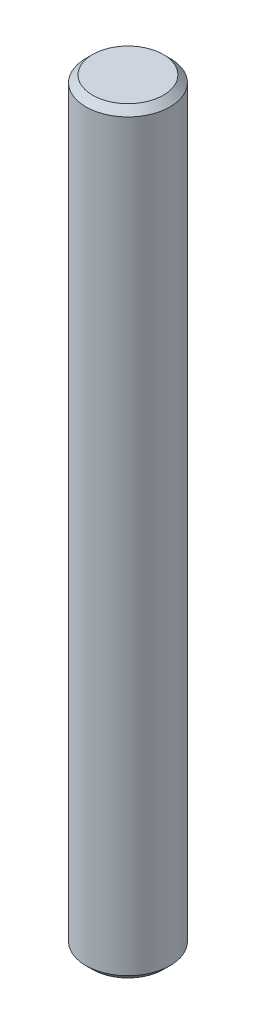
ISO-10303-21;
HEADER;
FILE_DESCRIPTION(('STEP AP214'),'2;1');
FILE_NAME('part.step','',(''),(''),'','','');
FILE_SCHEMA(('AUTOMOTIVE_DESIGN { 1 0 10303 214 1 1 1 1 }'));
ENDSEC;
DATA;
#1=APPLICATION_CONTEXT('core data for automotive mechanical design processes');
#2=APPLICATION_PROTOCOL_DEFINITION('international standard','automotive_design',2000,#1);
#3=PRODUCT_CONTEXT('',#1,'mechanical');
#4=PRODUCT('Part','Part','',(#3));
#5=PRODUCT_RELATED_PRODUCT_CATEGORY('part','',(#4));
#6=PRODUCT_DEFINITION_FORMATION('','',#4);
#7=PRODUCT_DEFINITION_CONTEXT('part definition',#1,'design');
#8=PRODUCT_DEFINITION('design','',#6,#7);
#9=PRODUCT_DEFINITION_SHAPE('','',#8);
#10=(LENGTH_UNIT() NAMED_UNIT(*) SI_UNIT(.MILLI.,.METRE.));
#11=(NAMED_UNIT(*) PLANE_ANGLE_UNIT() SI_UNIT($,.RADIAN.));
#12=(NAMED_UNIT(*) SI_UNIT($,.STERADIAN.) SOLID_ANGLE_UNIT());
#13=UNCERTAINTY_MEASURE_WITH_UNIT(LENGTH_MEASURE(1.E-05),#10,'distance_accuracy_value','');
#14=(GEOMETRIC_REPRESENTATION_CONTEXT(3) GLOBAL_UNCERTAINTY_ASSIGNED_CONTEXT((#13)) GLOBAL_UNIT_ASSIGNED_CONTEXT((#10,
#11,#12)) REPRESENTATION_CONTEXT('',''));
#15=CARTESIAN_POINT('',(0.,0.,0.));
#16=DIRECTION('',(0.,0.,1.));
#17=DIRECTION('',(1.,0.,0.));
#18=AXIS2_PLACEMENT_3D('',#15,#16,#17);
#19=CARTESIAN_POINT('',(0.,14.2875,0.));
#20=DIRECTION('',(0.,-1.,0.));
#21=DIRECTION('',(0.,0.,-1.));
#22=AXIS2_PLACEMENT_3D('',#19,#20,#21);
#23=CYLINDRICAL_SURFACE('',#22,1.5875);
#24=CARTESIAN_POINT('',(0.,-14.0335,0.));
#25=DIRECTION('',(0.,1.,0.));
#26=DIRECTION('',(0.,0.,1.));
#27=AXIS2_PLACEMENT_3D('',#24,#25,#26);
#28=CIRCLE('',#27,1.5875);
#29=CARTESIAN_POINT('',(0.,-14.0335,1.5875));
#30=VERTEX_POINT('',#29);
#31=EDGE_CURVE('E38',#30,#30,#28,.T.);
#32=ORIENTED_EDGE('',*,*,#31,.T.);
#33=EDGE_LOOP('',(#32));
#34=FACE_BOUND('',#33,.T.);
#35=CARTESIAN_POINT('',(0.,14.0335,0.));
#36=DIRECTION('',(0.,1.,0.));
#37=DIRECTION('',(0.,0.,1.));
#38=AXIS2_PLACEMENT_3D('',#35,#36,#37);
#39=CIRCLE('',#38,1.5875);
#40=CARTESIAN_POINT('',(0.,14.0335,1.5875));
#41=VERTEX_POINT('',#40);
#42=EDGE_CURVE('E42',#41,#41,#39,.F.);
#43=ORIENTED_EDGE('',*,*,#42,.T.);
#44=EDGE_LOOP('',(#43));
#45=FACE_BOUND('',#44,.T.);
#46=ADVANCED_FACE('F28',(#34,#45),#23,.T.);
#47=CARTESIAN_POINT('',(0.,14.2875,0.));
#48=DIRECTION('',(0.,1.,0.));
#49=DIRECTION('',(0.,0.,1.));
#50=AXIS2_PLACEMENT_3D('',#47,#48,#49);
#51=PLANE('',#50);
#52=CARTESIAN_POINT('',(0.,14.2875,0.));
#53=DIRECTION('',(0.,1.,0.));
#54=DIRECTION('',(0.,0.,1.));
#55=AXIS2_PLACEMENT_3D('',#52,#53,#54);
#56=CIRCLE('',#55,1.3335);
#57=CARTESIAN_POINT('',(0.,14.2875,1.3335));
#58=VERTEX_POINT('',#57);
#59=EDGE_CURVE('E10',#58,#58,#56,.T.);
#60=ORIENTED_EDGE('',*,*,#59,.T.);
#61=EDGE_LOOP('',(#60));
#62=FACE_BOUND('',#61,.T.);
#63=ADVANCED_FACE('F61',(#62),#51,.T.);
#64=CARTESIAN_POINT('',(0.,-14.2875,0.));
#65=DIRECTION('',(0.,1.,0.));
#66=DIRECTION('',(0.,0.,1.));
#67=AXIS2_PLACEMENT_3D('',#64,#65,#66);
#68=PLANE('',#67);
#69=CARTESIAN_POINT('',(0.,-14.2875,0.));
#70=DIRECTION('',(0.,1.,0.));
#71=DIRECTION('',(0.,0.,1.));
#72=AXIS2_PLACEMENT_3D('',#69,#70,#71);
#73=CIRCLE('',#72,1.3335);
#74=CARTESIAN_POINT('',(0.,-14.2875,1.3335));
#75=VERTEX_POINT('',#74);
#76=EDGE_CURVE('E34',#75,#75,#73,.F.);
#77=ORIENTED_EDGE('',*,*,#76,.T.);
#78=EDGE_LOOP('',(#77));
#79=FACE_BOUND('',#78,.T.);
#80=ADVANCED_FACE('F57',(#79),#68,.F.);
#81=CARTESIAN_POINT('',(0.,-14.0335,0.));
#82=DIRECTION('',(0.,1.,0.));
#83=DIRECTION('',(0.,0.,1.));
#84=AXIS2_PLACEMENT_3D('',#81,#82,#83);
#85=CONICAL_SURFACE('',#84,1.5875,0.785398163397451);
#86=ORIENTED_EDGE('',*,*,#76,.F.);
#87=EDGE_LOOP('',(#86));
#88=FACE_BOUND('',#87,.T.);
#89=ORIENTED_EDGE('',*,*,#31,.F.);
#90=EDGE_LOOP('',(#89));
#91=FACE_BOUND('',#90,.T.);
#92=ADVANCED_FACE('F52',(#88,#91),#85,.T.);
#93=CARTESIAN_POINT('',(0.,14.2875,0.));
#94=DIRECTION('',(0.,-1.,0.));
#95=DIRECTION('',(0.,0.,-1.));
#96=AXIS2_PLACEMENT_3D('',#93,#94,#95);
#97=CONICAL_SURFACE('',#96,1.3335,0.785398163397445);
#98=ORIENTED_EDGE('',*,*,#42,.F.);
#99=EDGE_LOOP('',(#98));
#100=FACE_BOUND('',#99,.T.);
#101=ORIENTED_EDGE('',*,*,#59,.F.);
#102=EDGE_LOOP('',(#101));
#103=FACE_BOUND('',#102,.T.);
#104=ADVANCED_FACE('F49',(#100,#103),#97,.T.);
#105=CLOSED_SHELL('',(#46,#63,#80,#92,#104));
#106=MANIFOLD_SOLID_BREP('B2',#105);
#107=ADVANCED_BREP_SHAPE_REPRESENTATION('',(#18,#106),#14);
#108=SHAPE_DEFINITION_REPRESENTATION(#9,#107);
ENDSEC;
END-ISO-10303-21;
